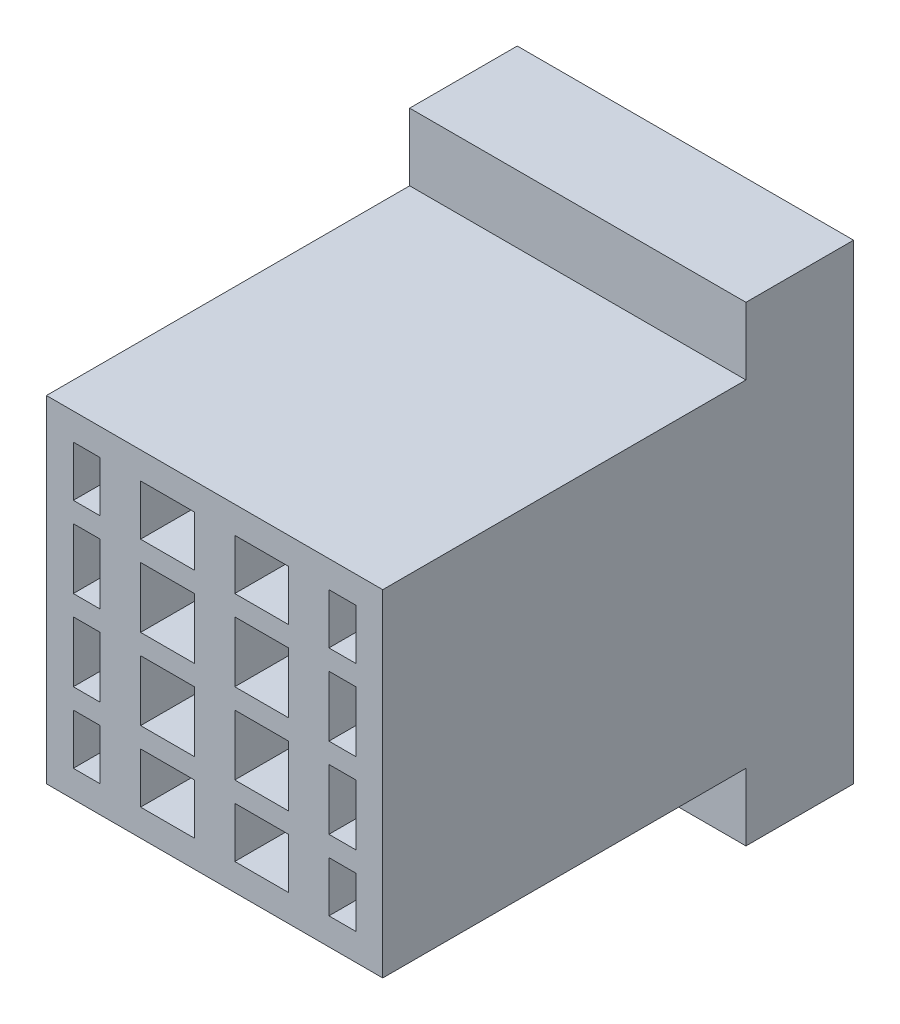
from build123d import *

# Parameters (mm, degrees)
SKETCH_8_W          = 25
SKETCH_8_H          = 25
SKETCH_8_W_2        = 4
SKETCH_8_H_2        = 21
SKETCH_8_W_3        = 2
EXTRUDE_7_DEPTH     = 25
SKETCH_9_W          = 25
SKETCH_9_H          = 25
EXTRUDE_8_DEPTH     = 2
SKETCH_11_W         = 25
SKETCH_11_H         = 35
EXTRUDE_9_DEPTH     = 6
SKETCH_12_W         = 21
SKETCH_12_H         = 30
CUT_EXTRUDE_1_DEPTH = 4
SKETCH_14_W         = 25
SKETCH_14_H         = 1.5
EXTRUDE_11_DEPTH    = 25
SKETCH_15_W         = 25
SKETCH_15_H         = 35
EXTRUDE_12_DEPTH    = 2


with BuildPart() as part:
    # Sketch 8 → Extrude 7 (new body)
    with BuildSketch(Plane.XY):
        Rectangle(SKETCH_8_W, SKETCH_8_H)
        with Locations((3.5, 0)):
            Rectangle(SKETCH_8_W_2, SKETCH_8_H_2, mode=Mode.SUBTRACT)
        with Locations((-3.5, 0)):
            Rectangle(SKETCH_8_W_2, SKETCH_8_H_2, mode=Mode.SUBTRACT)
        with Locations((-9.5, 0)):
            Rectangle(SKETCH_8_W_3, SKETCH_8_H_2, mode=Mode.SUBTRACT)
        with Locations((9.5, 0)):
            Rectangle(SKETCH_8_W_3, SKETCH_8_H_2, mode=Mode.SUBTRACT)
    extrude(amount=EXTRUDE_7_DEPTH)

    # Sketch 9 → Extrude 8 (add)
    with BuildSketch(Plane(origin=(0, 0, 0), x_dir=(-1, 0, 0), z_dir=(0, 0, -1))):
        Rectangle(SKETCH_9_W, SKETCH_9_H)
    extrude(amount=EXTRUDE_8_DEPTH)

    # Sketch 11 → Extrude 9 (add)
    with BuildSketch(Plane(origin=(0, 0, -2), x_dir=(-1, 0, 0), z_dir=(0, 0, -1))):
        Rectangle(SKETCH_11_W, SKETCH_11_H)
    extrude(amount=EXTRUDE_9_DEPTH)

    # Sketch 12 → Cut-Extrude 1 (cut)
    with BuildSketch(Plane(origin=(0, 0, -8), x_dir=(-1, 0, 0), z_dir=(0, 0, -1))):
        Rectangle(SKETCH_12_W, SKETCH_12_H)
    extrude(amount=-CUT_EXTRUDE_1_DEPTH, mode=Mode.SUBTRACT)

    # Sketch 14 → Extrude 11 (add)
    with BuildSketch(Plane.XY.offset(25)):
        Rectangle(SKETCH_14_W, SKETCH_14_H)
        with Locations((0, 6)):
            Rectangle(SKETCH_14_W, SKETCH_14_H)
        with Locations((0, -6)):
            Rectangle(SKETCH_14_W, SKETCH_14_H)
    extrude(amount=-EXTRUDE_11_DEPTH)

    # Sketch 15 → Extrude 12 (add)
    with BuildSketch(Plane(origin=(0, 0, -8), x_dir=(-1, 0, 0), z_dir=(0, 0, -1))):
        Rectangle(SKETCH_15_W, SKETCH_15_H)
    extrude(amount=EXTRUDE_12_DEPTH)


solid = part.part
